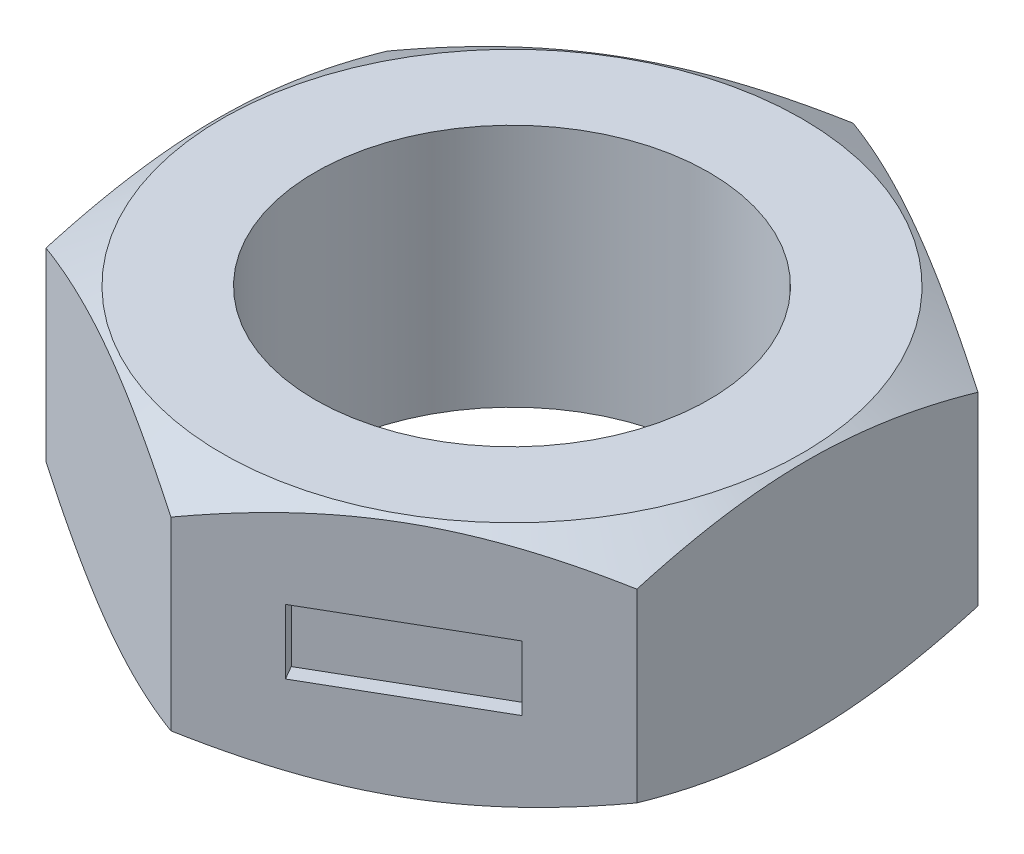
ISO-10303-21;
HEADER;
FILE_DESCRIPTION(('STEP AP214'),'2;1');
FILE_NAME('part.step','',(''),(''),'','','');
FILE_SCHEMA(('AUTOMOTIVE_DESIGN { 1 0 10303 214 1 1 1 1 }'));
ENDSEC;
DATA;
#1=APPLICATION_CONTEXT('core data for automotive mechanical design processes');
#2=APPLICATION_PROTOCOL_DEFINITION('international standard','automotive_design',2000,#1);
#3=PRODUCT_CONTEXT('',#1,'mechanical');
#4=PRODUCT('Part','Part','',(#3));
#5=PRODUCT_RELATED_PRODUCT_CATEGORY('part','',(#4));
#6=PRODUCT_DEFINITION_FORMATION('','',#4);
#7=PRODUCT_DEFINITION_CONTEXT('part definition',#1,'design');
#8=PRODUCT_DEFINITION('design','',#6,#7);
#9=PRODUCT_DEFINITION_SHAPE('','',#8);
#10=(LENGTH_UNIT() NAMED_UNIT(*) SI_UNIT(.MILLI.,.METRE.));
#11=(NAMED_UNIT(*) PLANE_ANGLE_UNIT() SI_UNIT($,.RADIAN.));
#12=(NAMED_UNIT(*) SI_UNIT($,.STERADIAN.) SOLID_ANGLE_UNIT());
#13=UNCERTAINTY_MEASURE_WITH_UNIT(LENGTH_MEASURE(1.E-05),#10,'distance_accuracy_value','');
#14=(GEOMETRIC_REPRESENTATION_CONTEXT(3) GLOBAL_UNCERTAINTY_ASSIGNED_CONTEXT((#13)) GLOBAL_UNIT_ASSIGNED_CONTEXT((#10,
#11,#12)) REPRESENTATION_CONTEXT('',''));
#15=CARTESIAN_POINT('',(0.,0.,0.));
#16=DIRECTION('',(0.,0.,1.));
#17=DIRECTION('',(1.,0.,0.));
#18=AXIS2_PLACEMENT_3D('',#15,#16,#17);
#19=CARTESIAN_POINT('',(-9.01699999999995,2.8956,2.79399999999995));
#20=DIRECTION('',(-1.,0.,0.));
#21=DIRECTION('',(0.,0.,1.));
#22=AXIS2_PLACEMENT_3D('',#19,#20,#21);
#23=PLANE('',#22);
#24=DIRECTION('',(0.,1.,0.));
#25=VECTOR('',#24,1.);
#26=CARTESIAN_POINT('',(-9.01699999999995,4.9784,-2.79400000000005));
#27=LINE('',#26,#25);
#28=CARTESIAN_POINT('',(-9.01699999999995,4.9784,-2.79400000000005));
#29=VERTEX_POINT('',#28);
#30=CARTESIAN_POINT('',(-9.01699999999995,2.8956,-2.79400000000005));
#31=VERTEX_POINT('',#30);
#32=EDGE_CURVE('E175',#29,#31,#27,.F.);
#33=ORIENTED_EDGE('',*,*,#32,.T.);
#34=DIRECTION('',(0.,0.,1.));
#35=VECTOR('',#34,1.);
#36=CARTESIAN_POINT('',(-9.01699999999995,2.8956,2.79399999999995));
#37=LINE('',#36,#35);
#38=CARTESIAN_POINT('',(-9.01699999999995,2.8956,2.79399999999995));
#39=VERTEX_POINT('',#38);
#40=EDGE_CURVE('E155',#39,#31,#37,.F.);
#41=ORIENTED_EDGE('',*,*,#40,.F.);
#42=DIRECTION('',(0.,1.,0.));
#43=VECTOR('',#42,1.);
#44=CARTESIAN_POINT('',(-9.01699999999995,2.8956,2.79399999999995));
#45=LINE('',#44,#43);
#46=CARTESIAN_POINT('',(-9.01699999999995,4.9784,2.79399999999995));
#47=VERTEX_POINT('',#46);
#48=EDGE_CURVE('E162',#39,#47,#45,.T.);
#49=ORIENTED_EDGE('',*,*,#48,.T.);
#50=DIRECTION('',(0.,0.,-1.));
#51=VECTOR('',#50,1.);
#52=CARTESIAN_POINT('',(-9.01699999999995,4.9784,-2.79400000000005));
#53=LINE('',#52,#51);
#54=EDGE_CURVE('E386',#29,#47,#53,.F.);
#55=ORIENTED_EDGE('',*,*,#54,.F.);
#56=EDGE_LOOP('',(#33,#41,#49,#55));
#57=FACE_BOUND('',#56,.T.);
#58=ADVANCED_FACE('F16',(#57),#23,.T.);
#59=CARTESIAN_POINT('',(2.08882502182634,2.8956,-9.20595106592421));
#60=DIRECTION('',(0.500000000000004,0.,-0.866025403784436));
#61=DIRECTION('',(-0.866025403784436,0.,-0.500000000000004));
#62=AXIS2_PLACEMENT_3D('',#59,#60,#61);
#63=PLANE('',#62);
#64=DIRECTION('',(0.,1.,0.));
#65=VECTOR('',#64,1.);
#66=CARTESIAN_POINT('',(6.92817497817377,4.9784,-6.41195106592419));
#67=LINE('',#66,#65);
#68=CARTESIAN_POINT('',(6.92817497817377,4.9784,-6.41195106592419));
#69=VERTEX_POINT('',#68);
#70=CARTESIAN_POINT('',(6.92817497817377,2.8956,-6.41195106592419));
#71=VERTEX_POINT('',#70);
#72=EDGE_CURVE('E374',#69,#71,#67,.F.);
#73=ORIENTED_EDGE('',*,*,#72,.T.);
#74=DIRECTION('',(0.866025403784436,0.,0.500000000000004));
#75=VECTOR('',#74,1.);
#76=CARTESIAN_POINT('',(2.08882502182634,2.8956,-9.20595106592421));
#77=LINE('',#76,#75);
#78=CARTESIAN_POINT('',(2.08882502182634,2.8956,-9.20595106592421));
#79=VERTEX_POINT('',#78);
#80=EDGE_CURVE('E377',#79,#71,#77,.T.);
#81=ORIENTED_EDGE('',*,*,#80,.F.);
#82=DIRECTION('',(0.,1.,0.));
#83=VECTOR('',#82,1.);
#84=CARTESIAN_POINT('',(2.08882502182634,2.8956,-9.20595106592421));
#85=LINE('',#84,#83);
#86=CARTESIAN_POINT('',(2.08882502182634,4.9784,-9.20595106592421));
#87=VERTEX_POINT('',#86);
#88=EDGE_CURVE('E382',#79,#87,#85,.T.);
#89=ORIENTED_EDGE('',*,*,#88,.T.);
#90=DIRECTION('',(-0.866025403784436,0.,-0.500000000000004));
#91=VECTOR('',#90,1.);
#92=CARTESIAN_POINT('',(6.92817497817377,4.9784,-6.41195106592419));
#93=LINE('',#92,#91);
#94=EDGE_CURVE('E366',#69,#87,#93,.T.);
#95=ORIENTED_EDGE('',*,*,#94,.F.);
#96=EDGE_LOOP('',(#73,#81,#89,#95));
#97=FACE_BOUND('',#96,.T.);
#98=ADVANCED_FACE('F416',(#97),#63,.T.);
#99=CARTESIAN_POINT('',(6.92817497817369,2.8956,6.41195106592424));
#100=DIRECTION('',(0.500000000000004,0.,0.866025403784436));
#101=DIRECTION('',(0.866025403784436,0.,-0.500000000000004));
#102=AXIS2_PLACEMENT_3D('',#99,#100,#101);
#103=PLANE('',#102);
#104=DIRECTION('',(0.,1.,0.));
#105=VECTOR('',#104,1.);
#106=CARTESIAN_POINT('',(2.08882502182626,4.9784,9.20595106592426));
#107=LINE('',#106,#105);
#108=CARTESIAN_POINT('',(2.08882502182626,4.9784,9.20595106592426));
#109=VERTEX_POINT('',#108);
#110=CARTESIAN_POINT('',(2.08882502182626,2.8956,9.20595106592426));
#111=VERTEX_POINT('',#110);
#112=EDGE_CURVE('E361',#109,#111,#107,.F.);
#113=ORIENTED_EDGE('',*,*,#112,.T.);
#114=DIRECTION('',(-0.866025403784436,0.,0.500000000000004));
#115=VECTOR('',#114,1.);
#116=CARTESIAN_POINT('',(6.92817497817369,2.8956,6.41195106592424));
#117=LINE('',#116,#115);
#118=CARTESIAN_POINT('',(6.92817497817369,2.8956,6.41195106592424));
#119=VERTEX_POINT('',#118);
#120=EDGE_CURVE('E359',#119,#111,#117,.T.);
#121=ORIENTED_EDGE('',*,*,#120,.F.);
#122=DIRECTION('',(0.,1.,0.));
#123=VECTOR('',#122,1.);
#124=CARTESIAN_POINT('',(6.92817497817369,2.8956,6.41195106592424));
#125=LINE('',#124,#123);
#126=CARTESIAN_POINT('',(6.92817497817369,4.9784,6.41195106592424));
#127=VERTEX_POINT('',#126);
#128=EDGE_CURVE('E351',#119,#127,#125,.T.);
#129=ORIENTED_EDGE('',*,*,#128,.T.);
#130=DIRECTION('',(0.866025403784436,0.,-0.500000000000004));
#131=VECTOR('',#130,1.);
#132=CARTESIAN_POINT('',(2.08882502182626,4.9784,9.20595106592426));
#133=LINE('',#132,#131);
#134=EDGE_CURVE('E346',#109,#127,#133,.T.);
#135=ORIENTED_EDGE('',*,*,#134,.F.);
#136=EDGE_LOOP('',(#113,#121,#129,#135));
#137=FACE_BOUND('',#136,.T.);
#138=ADVANCED_FACE('F414',(#137),#103,.T.);
#139=CARTESIAN_POINT('',(-9.01699999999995,2.8956,2.79399999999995));
#140=DIRECTION('',(0.,0.,1.));
#141=DIRECTION('',(1.,0.,0.));
#142=AXIS2_PLACEMENT_3D('',#139,#140,#141);
#143=PLANE('',#142);
#144=DIRECTION('',(1.,0.,0.));
#145=VECTOR('',#144,1.);
#146=CARTESIAN_POINT('',(-9.01699999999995,4.9784,2.79399999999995));
#147=LINE('',#146,#145);
#148=CARTESIAN_POINT('',(-9.525,4.9784,2.79399999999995));
#149=VERTEX_POINT('',#148);
#150=EDGE_CURVE('E167',#47,#149,#147,.F.);
#151=ORIENTED_EDGE('',*,*,#150,.F.);
#152=ORIENTED_EDGE('',*,*,#48,.F.);
#153=DIRECTION('',(1.,0.,0.));
#154=VECTOR('',#153,1.);
#155=CARTESIAN_POINT('',(-9.01699999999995,2.8956,2.79399999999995));
#156=LINE('',#155,#154);
#157=CARTESIAN_POINT('',(-9.52499999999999,2.8956,2.79399999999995));
#158=VERTEX_POINT('',#157);
#159=EDGE_CURVE('E165',#158,#39,#156,.T.);
#160=ORIENTED_EDGE('',*,*,#159,.F.);
#161=DIRECTION('',(0.,1.,0.));
#162=VECTOR('',#161,1.);
#163=CARTESIAN_POINT('',(-9.525,7.874,2.79399999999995));
#164=LINE('',#163,#162);
#165=EDGE_CURVE('E341',#149,#158,#164,.F.);
#166=ORIENTED_EDGE('',*,*,#165,.F.);
#167=EDGE_LOOP('',(#151,#152,#160,#166));
#168=FACE_BOUND('',#167,.T.);
#169=ADVANCED_FACE('F163',(#168),#143,.F.);
#170=CARTESIAN_POINT('',(-9.01699999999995,2.8956,2.79399999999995));
#171=DIRECTION('',(0.,1.,0.));
#172=DIRECTION('',(0.,0.,1.));
#173=AXIS2_PLACEMENT_3D('',#170,#171,#172);
#174=PLANE('',#173);
#175=ORIENTED_EDGE('',*,*,#40,.T.);
#176=DIRECTION('',(-1.,0.,0.));
#177=VECTOR('',#176,1.);
#178=CARTESIAN_POINT('',(-9.01699999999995,2.8956,-2.79400000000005));
#179=LINE('',#178,#177);
#180=CARTESIAN_POINT('',(-9.52499999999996,2.8956,-2.79400000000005));
#181=VERTEX_POINT('',#180);
#182=EDGE_CURVE('E177',#31,#181,#179,.T.);
#183=ORIENTED_EDGE('',*,*,#182,.T.);
#184=DIRECTION('',(0.,0.,1.));
#185=VECTOR('',#184,1.);
#186=CARTESIAN_POINT('',(-9.525,2.8956,5.49926131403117));
#187=LINE('',#186,#185);
#188=EDGE_CURVE('E172',#158,#181,#187,.F.);
#189=ORIENTED_EDGE('',*,*,#188,.F.);
#190=ORIENTED_EDGE('',*,*,#159,.T.);
#191=EDGE_LOOP('',(#175,#183,#189,#190));
#192=FACE_BOUND('',#191,.T.);
#193=ADVANCED_FACE('F171',(#192),#174,.T.);
#194=CARTESIAN_POINT('',(-9.01699999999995,4.9784,-2.79400000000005));
#195=DIRECTION('',(0.,0.,-1.));
#196=DIRECTION('',(-1.,0.,0.));
#197=AXIS2_PLACEMENT_3D('',#194,#195,#196);
#198=PLANE('',#197);
#199=ORIENTED_EDGE('',*,*,#182,.F.);
#200=ORIENTED_EDGE('',*,*,#32,.F.);
#201=DIRECTION('',(1.,0.,0.));
#202=VECTOR('',#201,1.);
#203=CARTESIAN_POINT('',(-9.01699999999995,4.9784,-2.79400000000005));
#204=LINE('',#203,#202);
#205=CARTESIAN_POINT('',(-9.52499999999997,4.9784,-2.79400000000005));
#206=VERTEX_POINT('',#205);
#207=EDGE_CURVE('E388',#206,#29,#204,.T.);
#208=ORIENTED_EDGE('',*,*,#207,.F.);
#209=DIRECTION('',(0.,1.,0.));
#210=VECTOR('',#209,1.);
#211=CARTESIAN_POINT('',(-9.525,7.874,-2.79400000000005));
#212=LINE('',#211,#210);
#213=EDGE_CURVE('E338',#181,#206,#212,.T.);
#214=ORIENTED_EDGE('',*,*,#213,.F.);
#215=EDGE_LOOP('',(#199,#200,#208,#214));
#216=FACE_BOUND('',#215,.T.);
#217=ADVANCED_FACE('F393',(#216),#198,.F.);
#218=CARTESIAN_POINT('',(-9.01699999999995,4.9784,-2.79400000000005));
#219=DIRECTION('',(0.,-1.,0.));
#220=DIRECTION('',(0.,0.,-1.));
#221=AXIS2_PLACEMENT_3D('',#218,#219,#220);
#222=PLANE('',#221);
#223=ORIENTED_EDGE('',*,*,#54,.T.);
#224=ORIENTED_EDGE('',*,*,#150,.T.);
#225=DIRECTION('',(0.,0.,1.));
#226=VECTOR('',#225,1.);
#227=CARTESIAN_POINT('',(-9.525,4.9784,5.49926131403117));
#228=LINE('',#227,#226);
#229=EDGE_CURVE('E328',#206,#149,#228,.T.);
#230=ORIENTED_EDGE('',*,*,#229,.F.);
#231=ORIENTED_EDGE('',*,*,#207,.T.);
#232=EDGE_LOOP('',(#223,#224,#230,#231));
#233=FACE_BOUND('',#232,.T.);
#234=ADVANCED_FACE('F396',(#233),#222,.T.);
#235=CARTESIAN_POINT('',(2.08882502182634,2.8956,-9.20595106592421));
#236=DIRECTION('',(-0.866025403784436,0.,-0.500000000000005));
#237=DIRECTION('',(-0.500000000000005,0.,0.866025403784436));
#238=AXIS2_PLACEMENT_3D('',#235,#236,#237);
#239=PLANE('',#238);
#240=DIRECTION('',(0.500000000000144,0.,-0.866025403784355));
#241=VECTOR('',#240,1.);
#242=CARTESIAN_POINT('',(2.08882502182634,4.9784,-9.20595106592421));
#243=LINE('',#242,#241);
#244=CARTESIAN_POINT('',(2.3428250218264,4.9784,-9.64589197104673));
#245=VERTEX_POINT('',#244);
#246=EDGE_CURVE('E364',#87,#245,#243,.T.);
#247=ORIENTED_EDGE('',*,*,#246,.F.);
#248=ORIENTED_EDGE('',*,*,#88,.F.);
#249=DIRECTION('',(-0.499999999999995,0.,0.866025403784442));
#250=VECTOR('',#249,1.);
#251=CARTESIAN_POINT('',(2.34282502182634,2.8956,-9.64589197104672));
#252=LINE('',#251,#250);
#253=CARTESIAN_POINT('',(2.34282502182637,2.8956,-9.64589197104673));
#254=VERTEX_POINT('',#253);
#255=EDGE_CURVE('E379',#254,#79,#252,.T.);
#256=ORIENTED_EDGE('',*,*,#255,.F.);
#257=DIRECTION('',(0.,1.,0.));
#258=VECTOR('',#257,1.);
#259=CARTESIAN_POINT('',(2.34282502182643,7.874,-9.6458919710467));
#260=LINE('',#259,#258);
#261=EDGE_CURVE('E330',#245,#254,#260,.F.);
#262=ORIENTED_EDGE('',*,*,#261,.F.);
#263=EDGE_LOOP('',(#247,#248,#256,#262));
#264=FACE_BOUND('',#263,.T.);
#265=ADVANCED_FACE('F398',(#264),#239,.F.);
#266=CARTESIAN_POINT('',(2.08882502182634,2.8956,-9.20595106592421));
#267=DIRECTION('',(0.,1.,0.));
#268=DIRECTION('',(0.,0.,1.));
#269=AXIS2_PLACEMENT_3D('',#266,#267,#268);
#270=PLANE('',#269);
#271=ORIENTED_EDGE('',*,*,#80,.T.);
#272=DIRECTION('',(0.500000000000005,0.,-0.866025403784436));
#273=VECTOR('',#272,1.);
#274=CARTESIAN_POINT('',(6.92817497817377,2.8956,-6.41195106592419));
#275=LINE('',#274,#273);
#276=CARTESIAN_POINT('',(7.18217497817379,2.8956,-6.85189197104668));
#277=VERTEX_POINT('',#276);
#278=EDGE_CURVE('E371',#71,#277,#275,.T.);
#279=ORIENTED_EDGE('',*,*,#278,.T.);
#280=DIRECTION('',(-0.866025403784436,0.,-0.500000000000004));
#281=VECTOR('',#280,1.);
#282=CARTESIAN_POINT('',(0.,2.8956,-10.9985226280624));
#283=LINE('',#282,#281);
#284=EDGE_CURVE('E332',#254,#277,#283,.F.);
#285=ORIENTED_EDGE('',*,*,#284,.F.);
#286=ORIENTED_EDGE('',*,*,#255,.T.);
#287=EDGE_LOOP('',(#271,#279,#285,#286));
#288=FACE_BOUND('',#287,.T.);
#289=ADVANCED_FACE('F404',(#288),#270,.T.);
#290=CARTESIAN_POINT('',(6.92817497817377,4.9784,-6.41195106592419));
#291=DIRECTION('',(0.866025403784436,0.,0.500000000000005));
#292=DIRECTION('',(0.500000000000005,0.,-0.866025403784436));
#293=AXIS2_PLACEMENT_3D('',#290,#291,#292);
#294=PLANE('',#293);
#295=ORIENTED_EDGE('',*,*,#278,.F.);
#296=ORIENTED_EDGE('',*,*,#72,.F.);
#297=DIRECTION('',(-0.500000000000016,0.,0.866025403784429));
#298=VECTOR('',#297,1.);
#299=CARTESIAN_POINT('',(7.18217497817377,4.9784,-6.85189197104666));
#300=LINE('',#299,#298);
#301=CARTESIAN_POINT('',(7.18217497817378,4.9784,-6.85189197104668));
#302=VERTEX_POINT('',#301);
#303=EDGE_CURVE('E368',#302,#69,#300,.T.);
#304=ORIENTED_EDGE('',*,*,#303,.F.);
#305=DIRECTION('',(0.,1.,0.));
#306=VECTOR('',#305,1.);
#307=CARTESIAN_POINT('',(7.18217497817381,7.874,-6.8518919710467));
#308=LINE('',#307,#306);
#309=EDGE_CURVE('E437',#277,#302,#308,.T.);
#310=ORIENTED_EDGE('',*,*,#309,.F.);
#311=EDGE_LOOP('',(#295,#296,#304,#310));
#312=FACE_BOUND('',#311,.T.);
#313=ADVANCED_FACE('F428',(#312),#294,.F.);
#314=CARTESIAN_POINT('',(6.92817497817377,4.9784,-6.41195106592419));
#315=DIRECTION('',(0.,-1.,0.));
#316=DIRECTION('',(0.,0.,-1.));
#317=AXIS2_PLACEMENT_3D('',#314,#315,#316);
#318=PLANE('',#317);
#319=ORIENTED_EDGE('',*,*,#94,.T.);
#320=ORIENTED_EDGE('',*,*,#246,.T.);
#321=DIRECTION('',(-0.866025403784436,0.,-0.500000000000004));
#322=VECTOR('',#321,1.);
#323=CARTESIAN_POINT('',(0.,4.9784,-10.9985226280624));
#324=LINE('',#323,#322);
#325=EDGE_CURVE('E434',#302,#245,#324,.T.);
#326=ORIENTED_EDGE('',*,*,#325,.F.);
#327=ORIENTED_EDGE('',*,*,#303,.T.);
#328=EDGE_LOOP('',(#319,#320,#326,#327));
#329=FACE_BOUND('',#328,.T.);
#330=ADVANCED_FACE('F432',(#329),#318,.T.);
#331=CARTESIAN_POINT('',(2.08882502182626,4.9784,9.20595106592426));
#332=DIRECTION('',(-0.866025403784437,0.,0.500000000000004));
#333=DIRECTION('',(0.500000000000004,0.,0.866025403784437));
#334=AXIS2_PLACEMENT_3D('',#331,#332,#333);
#335=PLANE('',#334);
#336=DIRECTION('',(0.499999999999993,0.,0.866025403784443));
#337=VECTOR('',#336,1.);
#338=CARTESIAN_POINT('',(2.08882502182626,2.8956,9.20595106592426));
#339=LINE('',#338,#337);
#340=CARTESIAN_POINT('',(2.34282502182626,2.8956,9.64589197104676));
#341=VERTEX_POINT('',#340);
#342=EDGE_CURVE('E357',#111,#341,#339,.T.);
#343=ORIENTED_EDGE('',*,*,#342,.F.);
#344=ORIENTED_EDGE('',*,*,#112,.F.);
#345=DIRECTION('',(-0.499999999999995,0.,-0.866025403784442));
#346=VECTOR('',#345,1.);
#347=CARTESIAN_POINT('',(2.34282502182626,4.9784,9.64589197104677));
#348=LINE('',#347,#346);
#349=CARTESIAN_POINT('',(2.34282502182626,4.9784,9.64589197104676));
#350=VERTEX_POINT('',#349);
#351=EDGE_CURVE('E348',#350,#109,#348,.T.);
#352=ORIENTED_EDGE('',*,*,#351,.F.);
#353=DIRECTION('',(0.,1.,0.));
#354=VECTOR('',#353,1.);
#355=CARTESIAN_POINT('',(2.34282502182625,7.874,9.64589197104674));
#356=LINE('',#355,#354);
#357=EDGE_CURVE('E483',#350,#341,#356,.F.);
#358=ORIENTED_EDGE('',*,*,#357,.T.);
#359=EDGE_LOOP('',(#343,#344,#352,#358));
#360=FACE_BOUND('',#359,.T.);
#361=ADVANCED_FACE('F454',(#360),#335,.F.);
#362=CARTESIAN_POINT('',(6.92817497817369,2.8956,6.41195106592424));
#363=DIRECTION('',(0.,1.,0.));
#364=DIRECTION('',(0.,0.,1.));
#365=AXIS2_PLACEMENT_3D('',#362,#363,#364);
#366=PLANE('',#365);
#367=ORIENTED_EDGE('',*,*,#120,.T.);
#368=ORIENTED_EDGE('',*,*,#342,.T.);
#369=DIRECTION('',(-0.866025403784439,0.,0.499999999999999));
#370=VECTOR('',#369,1.);
#371=CARTESIAN_POINT('',(0.,2.8956,10.9985226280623));
#372=LINE('',#371,#370);
#373=CARTESIAN_POINT('',(7.18217497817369,2.8956,6.85189197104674));
#374=VERTEX_POINT('',#373);
#375=EDGE_CURVE('E480',#341,#374,#372,.F.);
#376=ORIENTED_EDGE('',*,*,#375,.T.);
#377=DIRECTION('',(-0.500000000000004,0.,-0.866025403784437));
#378=VECTOR('',#377,1.);
#379=CARTESIAN_POINT('',(6.92817497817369,2.8956,6.41195106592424));
#380=LINE('',#379,#378);
#381=EDGE_CURVE('E354',#374,#119,#380,.T.);
#382=ORIENTED_EDGE('',*,*,#381,.T.);
#383=EDGE_LOOP('',(#367,#368,#376,#382));
#384=FACE_BOUND('',#383,.T.);
#385=ADVANCED_FACE('F457',(#384),#366,.T.);
#386=CARTESIAN_POINT('',(6.92817497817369,2.8956,6.41195106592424));
#387=DIRECTION('',(0.866025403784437,0.,-0.500000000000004));
#388=DIRECTION('',(-0.500000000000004,0.,-0.866025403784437));
#389=AXIS2_PLACEMENT_3D('',#386,#387,#388);
#390=PLANE('',#389);
#391=DIRECTION('',(0.499999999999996,0.,0.866025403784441));
#392=VECTOR('',#391,1.);
#393=CARTESIAN_POINT('',(6.92817497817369,4.9784,6.41195106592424));
#394=LINE('',#393,#392);
#395=CARTESIAN_POINT('',(7.18217497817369,4.9784,6.85189197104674));
#396=VERTEX_POINT('',#395);
#397=EDGE_CURVE('E86',#127,#396,#394,.T.);
#398=ORIENTED_EDGE('',*,*,#397,.F.);
#399=ORIENTED_EDGE('',*,*,#128,.F.);
#400=ORIENTED_EDGE('',*,*,#381,.F.);
#401=DIRECTION('',(0.,1.,0.));
#402=VECTOR('',#401,1.);
#403=CARTESIAN_POINT('',(7.18217497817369,7.874,6.85189197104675));
#404=LINE('',#403,#402);
#405=EDGE_CURVE('E476',#374,#396,#404,.T.);
#406=ORIENTED_EDGE('',*,*,#405,.T.);
#407=EDGE_LOOP('',(#398,#399,#400,#406));
#408=FACE_BOUND('',#407,.T.);
#409=ADVANCED_FACE('F461',(#408),#390,.F.);
#410=CARTESIAN_POINT('',(2.08882502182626,4.9784,9.20595106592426));
#411=DIRECTION('',(0.,-1.,0.));
#412=DIRECTION('',(0.,0.,-1.));
#413=AXIS2_PLACEMENT_3D('',#410,#411,#412);
#414=PLANE('',#413);
#415=ORIENTED_EDGE('',*,*,#134,.T.);
#416=ORIENTED_EDGE('',*,*,#397,.T.);
#417=DIRECTION('',(-0.866025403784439,0.,0.499999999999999));
#418=VECTOR('',#417,1.);
#419=CARTESIAN_POINT('',(0.,4.9784,10.9985226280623));
#420=LINE('',#419,#418);
#421=EDGE_CURVE('E479',#396,#350,#420,.T.);
#422=ORIENTED_EDGE('',*,*,#421,.T.);
#423=ORIENTED_EDGE('',*,*,#351,.T.);
#424=EDGE_LOOP('',(#415,#416,#422,#423));
#425=FACE_BOUND('',#424,.T.);
#426=ADVANCED_FACE('F464',(#425),#414,.T.);
#427=CARTESIAN_POINT('',(-9.525,7.874,5.49926131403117));
#428=DIRECTION('',(0.499999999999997,0.,-0.866025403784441));
#429=DIRECTION('',(-0.866025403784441,0.,-0.499999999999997));
#430=AXIS2_PLACEMENT_3D('',#427,#428,#429);
#431=PLANE('',#430);
#432=DIRECTION('',(0.,1.,0.));
#433=VECTOR('',#432,1.);
#434=CARTESIAN_POINT('',(0.,7.874,10.9985226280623));
#435=LINE('',#434,#433);
#436=CARTESIAN_POINT('',(-1.70747101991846E-08,0.952499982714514,10.9985226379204));
#437=VERTEX_POINT('',#436);
#438=CARTESIAN_POINT('',(-3.48504221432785E-08,6.92150003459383,10.9985226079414));
#439=VERTEX_POINT('',#438);
#440=EDGE_CURVE('E439',#437,#439,#435,.T.);
#441=ORIENTED_EDGE('',*,*,#440,.T.);
#442=CARTESIAN_POINT('',(-9.52500003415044,6.92150001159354,5.49926129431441));
#443=CARTESIAN_POINT('',(-9.31562139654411,6.99127940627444,5.62014610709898));
#444=CARTESIAN_POINT('',(-9.10546208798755,7.05789154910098,5.74148164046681));
#445=CARTESIAN_POINT('',(-8.68345816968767,7.18390254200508,5.98512571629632));
#446=CARTESIAN_POINT('',(-8.47161302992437,7.24329901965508,6.10743456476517));
#447=CARTESIAN_POINT('',(-7.83266430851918,7.40951541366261,6.47633178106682));
#448=CARTESIAN_POINT('',(-7.40303844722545,7.50405743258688,6.72437638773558));
#449=CARTESIAN_POINT('',(-6.76012305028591,7.61491481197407,7.09556376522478));
#450=CARTESIAN_POINT('',(-6.54875413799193,7.64649352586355,7.21759766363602));
#451=CARTESIAN_POINT('',(-6.12503778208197,7.69944807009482,7.46223041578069));
#452=CARTESIAN_POINT('',(-5.91269031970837,7.72082370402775,7.58482928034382));
#453=CARTESIAN_POINT('',(-5.48764127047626,7.75282439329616,7.83023146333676));
#454=CARTESIAN_POINT('',(-5.27494040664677,7.76346222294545,7.95303436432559));
#455=CARTESIAN_POINT('',(-4.84934231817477,7.77376126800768,8.19875353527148));
#456=CARTESIAN_POINT('',(-4.63644509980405,7.77342282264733,8.32166980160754));
#457=CARTESIAN_POINT('',(-4.23844161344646,7.76253369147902,8.5514572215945));
#458=CARTESIAN_POINT('',(-4.05330722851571,7.75331134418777,8.65834460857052));
#459=CARTESIAN_POINT('',(-3.68347146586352,7.72674534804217,8.87186938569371));
#460=CARTESIAN_POINT('',(-3.49877011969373,7.70940112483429,8.97850675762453));
#461=CARTESIAN_POINT('',(-2.94538178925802,7.64559564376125,9.29800565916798));
#462=CARTESIAN_POINT('',(-2.57767430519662,7.58736952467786,9.51030167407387));
#463=CARTESIAN_POINT('',(-1.83835936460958,7.441806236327,9.93714535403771));
#464=CARTESIAN_POINT('',(-1.46684624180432,7.353852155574,10.1516385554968));
#465=CARTESIAN_POINT('',(-0.72935956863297,7.1542338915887,10.577426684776));
#466=CARTESIAN_POINT('',(-0.363376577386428,7.04261658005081,10.788727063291));
#467=CARTESIAN_POINT('',(-7.02856196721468E-08,6.92150004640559,10.9985225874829));
#468=B_SPLINE_CURVE_WITH_KNOTS('',3,(#442,#443,#444,#445,#446,#447,#448,#449,#450,#451,#452,
#453,#454,#455,#456,#457,#458,#459,#460,#461,#462,#463,#464,#465,#466,#467),.UNSPECIFIED.,.F.,
.F.,(4,2,2,2,2,2,2,2,2,2,2,2,4),(0.,0.754853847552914,1.50995521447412,3.02337201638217,
3.76150689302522,4.49965597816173,5.23692587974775,5.97417299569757,6.61593390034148,
7.25774019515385,8.54226458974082,9.85527357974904,11.1657056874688),.UNSPECIFIED.);
#469=CARTESIAN_POINT('',(-9.525,6.9215000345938,5.49926127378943));
#470=VERTEX_POINT('',#469);
#471=EDGE_CURVE('E255',#470,#439,#468,.T.);
#472=ORIENTED_EDGE('',*,*,#471,.F.);
#473=DIRECTION('',(0.,1.,0.));
#474=VECTOR('',#473,1.);
#475=CARTESIAN_POINT('',(-9.525,7.874,5.49926131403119));
#476=LINE('',#475,#474);
#477=CARTESIAN_POINT('',(-9.52499996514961,0.952499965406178,5.49926133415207));
#478=VERTEX_POINT('',#477);
#479=EDGE_CURVE('E343',#478,#470,#476,.T.);
#480=ORIENTED_EDGE('',*,*,#479,.F.);
#481=CARTESIAN_POINT('',(-6.82180437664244E-08,0.952499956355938,10.9985225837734));
#482=CARTESIAN_POINT('',(-0.209378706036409,0.882720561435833,10.8776377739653));
#483=CARTESIAN_POINT('',(-0.419538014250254,0.816108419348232,10.7563022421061));
#484=CARTESIAN_POINT('',(-0.84154193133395,0.690097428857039,10.512658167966));
#485=CARTESIAN_POINT('',(-1.05338707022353,0.630700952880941,10.3903493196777));
#486=CARTESIAN_POINT('',(-1.69233578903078,0.464484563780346,10.0214521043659));
#487=CARTESIAN_POINT('',(-2.12196164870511,0.369942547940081,9.77340749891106));
#488=CARTESIAN_POINT('',(-2.76487704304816,0.259085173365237,9.40222012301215));
#489=CARTESIAN_POINT('',(-2.97624595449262,0.227506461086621,9.28018622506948));
#490=CARTESIAN_POINT('',(-3.39996230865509,0.174551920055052,9.03555347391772));
#491=CARTESIAN_POINT('',(-3.61230977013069,0.153176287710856,8.91295460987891));
#492=CARTESIAN_POINT('',(-4.03735881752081,0.121175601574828,8.66755242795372));
#493=CARTESIAN_POINT('',(-4.25005968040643,0.11053777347,8.54474952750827));
#494=CARTESIAN_POINT('',(-4.67565776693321,0.100238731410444,8.29903035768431));
#495=CARTESIAN_POINT('',(-4.8885549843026,0.10057717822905,8.1761140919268));
#496=CARTESIAN_POINT('',(-5.28655846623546,0.111466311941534,7.94632667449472));
#497=CARTESIAN_POINT('',(-5.47169284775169,0.120688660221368,7.83943928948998));
#498=CARTESIAN_POINT('',(-5.84152860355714,0.147254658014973,7.62591451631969));
#499=CARTESIAN_POINT('',(-6.0262299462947,0.164598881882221,7.51927714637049));
#500=CARTESIAN_POINT('',(-6.57961826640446,0.228404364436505,7.19977825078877));
#501=CARTESIAN_POINT('',(-6.94732574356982,0.286630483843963,6.9874822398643));
#502=CARTESIAN_POINT('',(-7.68664067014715,0.432193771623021,6.56063856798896));
#503=CARTESIAN_POINT('',(-8.05815378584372,0.520147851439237,6.34614537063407));
#504=CARTESIAN_POINT('',(-8.7956404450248,0.71976611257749,5.92035724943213));
#505=CARTESIAN_POINT('',(-9.16162342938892,0.831383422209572,5.70905687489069));
#506=CARTESIAN_POINT('',(-9.52499992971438,0.952499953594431,5.49926135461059));
#507=B_SPLINE_CURVE_WITH_KNOTS('',3,(#481,#482,#483,#484,#485,#486,#487,#488,#489,#490,#491,
#492,#493,#494,#495,#496,#497,#498,#499,#500,#501,#502,#503,#504,#505,#506),.UNSPECIFIED.,.F.,
.F.,(4,2,2,2,2,2,2,2,2,2,2,2,4),(0.,0.754853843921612,1.50995520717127,3.02337200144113,
3.76150687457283,4.49965595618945,5.23692585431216,5.97417296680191,6.61593385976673,
7.25774014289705,8.54226451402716,9.8552734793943,11.1657055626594),.UNSPECIFIED.);
#508=EDGE_CURVE('E315',#437,#478,#507,.T.);
#509=ORIENTED_EDGE('',*,*,#508,.F.);
#510=EDGE_LOOP('',(#441,#472,#480,#509));
#511=FACE_BOUND('',#510,.T.);
#512=ADVANCED_FACE('F244',(#511),#431,.F.);
#513=CARTESIAN_POINT('',(-9.525,7.874,5.49926131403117));
#514=DIRECTION('',(-1.,0.,0.));
#515=DIRECTION('',(0.,0.,1.));
#516=AXIS2_PLACEMENT_3D('',#513,#514,#515);
#517=PLANE('',#516);
#518=ORIENTED_EDGE('',*,*,#213,.T.);
#519=ORIENTED_EDGE('',*,*,#229,.T.);
#520=ORIENTED_EDGE('',*,*,#165,.T.);
#521=ORIENTED_EDGE('',*,*,#188,.T.);
#522=EDGE_LOOP('',(#518,#519,#520,#521));
#523=FACE_BOUND('',#522,.T.);
#524=ORIENTED_EDGE('',*,*,#479,.T.);
#525=CARTESIAN_POINT('',(-9.525,6.92150001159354,-5.4992613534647));
#526=CARTESIAN_POINT('',(-9.525,6.99127940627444,-5.25749172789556));
#527=CARTESIAN_POINT('',(-9.525,7.05789154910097,-5.01482066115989));
#528=CARTESIAN_POINT('',(-9.525,7.18390254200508,-4.52753250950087));
#529=CARTESIAN_POINT('',(-9.525,7.24329901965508,-4.28291481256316));
#530=CARTESIAN_POINT('',(-9.525,7.40951541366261,-3.54512037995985));
#531=CARTESIAN_POINT('',(-9.525,7.50405743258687,-3.04903116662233));
#532=CARTESIAN_POINT('',(-9.525,7.61491481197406,-2.30665641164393));
#533=CARTESIAN_POINT('',(-9.525,7.64649352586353,-2.06258861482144));
#534=CARTESIAN_POINT('',(-9.525,7.69944807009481,-1.57332311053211));
#535=CARTESIAN_POINT('',(-9.525,7.72082370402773,-1.32812538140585));
#536=CARTESIAN_POINT('',(-9.525,7.75282439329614,-0.83732101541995));
#537=CARTESIAN_POINT('',(-9.525,7.76346222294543,-0.591715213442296));
#538=CARTESIAN_POINT('',(-9.525,7.77376126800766,-0.100276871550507));
#539=CARTESIAN_POINT('',(-9.525,7.77342282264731,0.145555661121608));
#540=CARTESIAN_POINT('',(-9.525,7.762533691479,0.60513050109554));
#541=CARTESIAN_POINT('',(-9.525,7.75331134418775,0.818905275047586));
#542=CARTESIAN_POINT('',(-9.525,7.72674534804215,1.24595482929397));
#543=CARTESIAN_POINT('',(-9.525,7.70940112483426,1.45922957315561));
#544=CARTESIAN_POINT('',(-9.525,7.64559564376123,2.09822737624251));
#545=CARTESIAN_POINT('',(-9.525,7.58736952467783,2.5228194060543));
#546=CARTESIAN_POINT('',(-9.525,7.44180623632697,3.37650676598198));
#547=CARTESIAN_POINT('',(-9.525,7.35385215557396,3.80549316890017));
#548=CARTESIAN_POINT('',(-9.525,7.15423389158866,4.65706942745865));
#549=CARTESIAN_POINT('',(-9.525,7.04261658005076,5.07967018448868));
#550=CARTESIAN_POINT('',(-9.525,6.92150004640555,5.49926123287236));
#551=B_SPLINE_CURVE_WITH_KNOTS('',3,(#525,#526,#527,#528,#529,#530,#531,#532,#533,#534,#535,
#536,#537,#538,#539,#540,#541,#542,#543,#544,#545,#546,#547,#548,#549,#550),.UNSPECIFIED.,.F.,
.F.,(4,2,2,2,2,2,2,2,2,2,2,2,4),(0.,0.754853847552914,1.50995521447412,3.02337201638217,
3.76150689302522,4.49965597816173,5.23692587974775,5.97417299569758,6.61593390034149,
7.25774019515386,8.54226458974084,9.85527357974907,11.1657056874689),.UNSPECIFIED.);
#552=CARTESIAN_POINT('',(-9.52499996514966,6.92150003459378,-5.49926133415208));
#553=VERTEX_POINT('',#552);
#554=EDGE_CURVE('E249',#553,#470,#551,.T.);
#555=ORIENTED_EDGE('',*,*,#554,.F.);
#556=DIRECTION('',(0.,1.,0.));
#557=VECTOR('',#556,1.);
#558=CARTESIAN_POINT('',(-9.52500000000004,7.874,-5.4992613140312));
#559=LINE('',#558,#557);
#560=CARTESIAN_POINT('',(-9.52500000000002,0.95249996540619,-5.49926127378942));
#561=VERTEX_POINT('',#560);
#562=EDGE_CURVE('E327',#561,#553,#559,.T.);
#563=ORIENTED_EDGE('',*,*,#562,.F.);
#564=CARTESIAN_POINT('',(-9.525,0.952499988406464,5.49926135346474));
#565=CARTESIAN_POINT('',(-9.525,0.882720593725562,5.2574917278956));
#566=CARTESIAN_POINT('',(-9.525,0.816108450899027,5.01482066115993));
#567=CARTESIAN_POINT('',(-9.525,0.690097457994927,4.52753250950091));
#568=CARTESIAN_POINT('',(-9.525,0.630700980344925,4.2829148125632));
#569=CARTESIAN_POINT('',(-9.525,0.464484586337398,3.54512037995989));
#570=CARTESIAN_POINT('',(-9.525,0.369942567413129,3.04903116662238));
#571=CARTESIAN_POINT('',(-9.525,0.259085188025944,2.30665641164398));
#572=CARTESIAN_POINT('',(-9.525,0.227506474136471,2.06258861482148));
#573=CARTESIAN_POINT('',(-9.525,0.174551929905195,1.57332311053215));
#574=CARTESIAN_POINT('',(-9.525,0.153176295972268,1.3281253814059));
#575=CARTESIAN_POINT('',(-9.525,0.12117560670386,0.837321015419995));
#576=CARTESIAN_POINT('',(-9.525,0.110537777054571,0.591715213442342));
#577=CARTESIAN_POINT('',(-9.525,0.100238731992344,0.100276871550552));
#578=CARTESIAN_POINT('',(-9.525,0.10057717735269,-0.145555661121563));
#579=CARTESIAN_POINT('',(-9.525,0.111466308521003,-0.605130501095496));
#580=CARTESIAN_POINT('',(-9.525,0.120688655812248,-0.818905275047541));
#581=CARTESIAN_POINT('',(-9.525,0.14725465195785,-1.24595482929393));
#582=CARTESIAN_POINT('',(-9.525,0.164598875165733,-1.45922957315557));
#583=CARTESIAN_POINT('',(-9.525,0.228404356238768,-2.09822737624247));
#584=CARTESIAN_POINT('',(-9.525,0.286630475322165,-2.52281940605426));
#585=CARTESIAN_POINT('',(-9.525,0.432193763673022,-3.37650676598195));
#586=CARTESIAN_POINT('',(-9.525,0.520147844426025,-3.80549316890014));
#587=CARTESIAN_POINT('',(-9.525,0.719766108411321,-4.65706942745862));
#588=CARTESIAN_POINT('',(-9.525,0.831383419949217,-5.07967018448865));
#589=CARTESIAN_POINT('',(-9.525,0.952499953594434,-5.49926123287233));
#590=B_SPLINE_CURVE_WITH_KNOTS('',3,(#564,#565,#566,#567,#568,#569,#570,#571,#572,#573,#574,
#575,#576,#577,#578,#579,#580,#581,#582,#583,#584,#585,#586,#587,#588,#589),.UNSPECIFIED.,.F.,
.F.,(4,2,2,2,2,2,2,2,2,2,2,2,4),(0.,0.754853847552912,1.50995521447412,3.02337201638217,
3.76150689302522,4.49965597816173,5.23692587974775,5.97417299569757,6.61593390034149,
7.25774019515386,8.54226458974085,9.85527357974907,11.1657056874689),.UNSPECIFIED.);
#591=EDGE_CURVE('E214',#478,#561,#590,.T.);
#592=ORIENTED_EDGE('',*,*,#591,.F.);
#593=EDGE_LOOP('',(#524,#555,#563,#592));
#594=FACE_BOUND('',#593,.T.);
#595=ADVANCED_FACE('F237',(#523,#594),#517,.T.);
#596=CARTESIAN_POINT('',(-9.525,7.874,-5.49926131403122));
#597=DIRECTION('',(-0.5,0.,-0.866025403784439));
#598=DIRECTION('',(-0.866025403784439,0.,0.5));
#599=AXIS2_PLACEMENT_3D('',#596,#597,#598);
#600=PLANE('',#599);
#601=ORIENTED_EDGE('',*,*,#562,.T.);
#602=CARTESIAN_POINT('',(-1.777515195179E-08,6.92150002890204,-10.9985226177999));
#603=CARTESIAN_POINT('',(-0.20937865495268,6.99127942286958,-10.8776378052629));
#604=CARTESIAN_POINT('',(-0.419537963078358,7.05789156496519,-10.7563022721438));
#605=CARTESIAN_POINT('',(-0.841541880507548,7.18390255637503,-10.512658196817));
#606=CARTESIAN_POINT('',(-1.05338701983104,7.24329903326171,-10.3903493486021));
#607=CARTESIAN_POINT('',(-1.69233573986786,7.40951542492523,-10.0214521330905));
#608=CARTESIAN_POINT('',(-2.12196160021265,7.50405744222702,-9.77340752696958));
#609=CARTESIAN_POINT('',(-2.76487699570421,7.61491481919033,-9.40222015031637));
#610=CARTESIAN_POINT('',(-2.97624590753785,7.64649353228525,-9.2801862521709));
#611=CARTESIAN_POINT('',(-3.39996226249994,7.69944807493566,-9.03555350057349));
#612=CARTESIAN_POINT('',(-3.612309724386,7.72082370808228,-8.91295463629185));
#613=CARTESIAN_POINT('',(-4.03735877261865,7.75282439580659,-8.66755245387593));
#614=CARTESIAN_POINT('',(-4.25005963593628,7.76346222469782,-8.54474955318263));
#615=CARTESIAN_POINT('',(-4.67565772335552,7.77376126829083,-8.29903038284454));
#616=CARTESIAN_POINT('',(-4.88855494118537,7.77342282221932,-8.17611411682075));
#617=CARTESIAN_POINT('',(-5.28655842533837,7.76253368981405,-7.94632669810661));
#618=CARTESIAN_POINT('',(-5.47169280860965,7.75331134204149,-7.83943931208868));
#619=CARTESIAN_POINT('',(-5.84152856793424,7.72674534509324,-7.62591453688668));
#620=CARTESIAN_POINT('',(-6.02622991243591,7.70940112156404,-7.51927716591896));
#621=CARTESIAN_POINT('',(-6.57961823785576,7.64559563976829,-7.19977826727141));
#622=CARTESIAN_POINT('',(-6.94732571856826,7.58736952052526,-6.98748225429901));
#623=CARTESIAN_POINT('',(-7.68664065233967,7.44180623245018,-6.56063857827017));
#624=CARTESIAN_POINT('',(-8.05815377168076,7.35385215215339,-6.34614537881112));
#625=CARTESIAN_POINT('',(-8.79564043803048,7.15423388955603,-5.92035725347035));
#626=CARTESIAN_POINT('',(-9.1616234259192,7.04261657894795,-5.70905687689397));
#627=CARTESIAN_POINT('',(-9.52499992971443,6.92150004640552,-5.49926135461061));
#628=B_SPLINE_CURVE_WITH_KNOTS('',3,(#602,#603,#604,#605,#606,#607,#608,#609,#610,#611,#612,
#613,#614,#615,#616,#617,#618,#619,#620,#621,#622,#623,#624,#625,#626,#627),.UNSPECIFIED.,.F.,
.F.,(4,2,2,2,2,2,2,2,2,2,2,2,4),(0.,0.75485384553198,1.50995521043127,3.02337200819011,
3.76150688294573,4.49965596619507,5.23692586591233,5.97417297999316,6.61593387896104,
7.25774016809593,8.54226455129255,9.855273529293,11.1657056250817),.UNSPECIFIED.);
#629=CARTESIAN_POINT('',(8.88760617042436E-09,6.92150002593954,-10.9985226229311));
#630=VERTEX_POINT('',#629);
#631=EDGE_CURVE('E19',#630,#553,#628,.T.);
#632=ORIENTED_EDGE('',*,*,#631,.F.);
#633=DIRECTION('',(0.,1.,0.));
#634=VECTOR('',#633,1.);
#635=CARTESIAN_POINT('',(0.,7.874,-10.9985226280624));
#636=LINE('',#635,#634);
#637=CARTESIAN_POINT('',(-3.48503840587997E-08,0.952499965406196,-10.9985226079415));
#638=VERTEX_POINT('',#637);
#639=EDGE_CURVE('E76',#638,#630,#636,.T.);
#640=ORIENTED_EDGE('',*,*,#639,.F.);
#641=CARTESIAN_POINT('',(-9.52500003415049,0.952499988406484,-5.49926129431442));
#642=CARTESIAN_POINT('',(-9.31562139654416,0.882720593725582,-5.620146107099));
#643=CARTESIAN_POINT('',(-9.1054620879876,0.816108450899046,-5.74148164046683));
#644=CARTESIAN_POINT('',(-8.68345816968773,0.690097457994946,-5.98512571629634));
#645=CARTESIAN_POINT('',(-8.47161302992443,0.630700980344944,-6.1074345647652));
#646=CARTESIAN_POINT('',(-7.83266430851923,0.464484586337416,-6.47633178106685));
#647=CARTESIAN_POINT('',(-7.40303844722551,0.369942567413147,-6.72437638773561));
#648=CARTESIAN_POINT('',(-6.76012305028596,0.259085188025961,-7.09556376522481));
#649=CARTESIAN_POINT('',(-6.54875413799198,0.227506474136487,-7.21759766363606));
#650=CARTESIAN_POINT('',(-6.12503778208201,0.174551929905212,-7.46223041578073));
#651=CARTESIAN_POINT('',(-5.91269031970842,0.153176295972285,-7.58482928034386));
#652=CARTESIAN_POINT('',(-5.48764127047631,0.121175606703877,-7.8302314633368));
#653=CARTESIAN_POINT('',(-5.27494040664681,0.110537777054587,-7.95303436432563));
#654=CARTESIAN_POINT('',(-4.84934231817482,0.100238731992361,-8.19875353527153));
#655=CARTESIAN_POINT('',(-4.6364450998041,0.100577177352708,-8.32166980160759));
#656=CARTESIAN_POINT('',(-4.2384416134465,0.111466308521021,-8.55145722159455));
#657=CARTESIAN_POINT('',(-4.05330722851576,0.120688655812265,-8.65834460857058));
#658=CARTESIAN_POINT('',(-3.68347146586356,0.147254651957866,-8.87186938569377));
#659=CARTESIAN_POINT('',(-3.49877011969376,0.16459887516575,-8.97850675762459));
#660=CARTESIAN_POINT('',(-2.94538178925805,0.228404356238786,-9.29800565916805));
#661=CARTESIAN_POINT('',(-2.57767430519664,0.286630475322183,-9.51030167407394));
#662=CARTESIAN_POINT('',(-1.83835936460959,0.432193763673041,-9.93714535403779));
#663=CARTESIAN_POINT('',(-1.46684624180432,0.520147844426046,-10.1516385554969));
#664=CARTESIAN_POINT('',(-0.729359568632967,0.719766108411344,-10.5774266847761));
#665=CARTESIAN_POINT('',(-0.363376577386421,0.831383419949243,-10.7887270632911));
#666=CARTESIAN_POINT('',(-7.02856062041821E-08,0.95249995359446,-10.998522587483));
#667=B_SPLINE_CURVE_WITH_KNOTS('',3,(#641,#642,#643,#644,#645,#646,#647,#648,#649,#650,#651,
#652,#653,#654,#655,#656,#657,#658,#659,#660,#661,#662,#663,#664,#665,#666),.UNSPECIFIED.,.F.,
.F.,(4,2,2,2,2,2,2,2,2,2,2,2,4),(0.,0.754853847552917,1.50995521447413,3.02337201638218,
3.76150689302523,4.49965597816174,5.23692587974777,5.97417299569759,6.61593390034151,
7.25774019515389,8.54226458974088,9.85527357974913,11.1657056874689),.UNSPECIFIED.);
#668=EDGE_CURVE('E229',#561,#638,#667,.T.);
#669=ORIENTED_EDGE('',*,*,#668,.F.);
#670=EDGE_LOOP('',(#601,#632,#640,#669));
#671=FACE_BOUND('',#670,.T.);
#672=ADVANCED_FACE('F233',(#671),#600,.T.);
#673=CARTESIAN_POINT('',(0.,7.874,-10.9985226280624));
#674=DIRECTION('',(0.500000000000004,0.,-0.866025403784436));
#675=DIRECTION('',(-0.866025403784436,0.,-0.500000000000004));
#676=AXIS2_PLACEMENT_3D('',#673,#674,#675);
#677=PLANE('',#676);
#678=ORIENTED_EDGE('',*,*,#309,.T.);
#679=ORIENTED_EDGE('',*,*,#325,.T.);
#680=ORIENTED_EDGE('',*,*,#261,.T.);
#681=ORIENTED_EDGE('',*,*,#284,.T.);
#682=EDGE_LOOP('',(#678,#679,#680,#681));
#683=FACE_BOUND('',#682,.T.);
#684=ORIENTED_EDGE('',*,*,#639,.T.);
#685=CARTESIAN_POINT('',(9.52500003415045,6.92150001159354,-5.49926129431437));
#686=CARTESIAN_POINT('',(9.3156213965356,6.99127940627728,-5.62014610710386));
#687=CARTESIAN_POINT('',(9.10546208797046,7.0578915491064,-5.74148164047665));
#688=CARTESIAN_POINT('',(8.68345816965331,7.18390254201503,-5.98512571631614));
#689=CARTESIAN_POINT('',(8.47161302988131,7.24329901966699,-6.10743456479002));
#690=CARTESIAN_POINT('',(7.83266430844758,7.40951541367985,-6.47633178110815));
#691=CARTESIAN_POINT('',(7.40303844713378,7.50405743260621,-6.7243763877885));
#692=CARTESIAN_POINT('',(6.76012305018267,7.61491481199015,-7.09556376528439));
#693=CARTESIAN_POINT('',(6.54875413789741,7.64649352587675,-7.2175976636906));
#694=CARTESIAN_POINT('',(6.12503778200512,7.69944807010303,-7.46223041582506));
#695=CARTESIAN_POINT('',(5.91269031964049,7.72082370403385,-7.58482928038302));
#696=CARTESIAN_POINT('',(5.48764127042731,7.75282439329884,-7.83023146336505));
#697=CARTESIAN_POINT('',(5.27494040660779,7.76346222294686,-7.95303436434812));
#698=CARTESIAN_POINT('',(4.84934231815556,7.77376126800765,-8.1987535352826));
#699=CARTESIAN_POINT('',(4.63644509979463,7.77342282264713,-8.32166980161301));
#700=CARTESIAN_POINT('',(4.23844161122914,7.76253369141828,-8.55145722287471));
#701=CARTESIAN_POINT('',(4.0533072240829,7.75331134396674,-8.65834461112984));
#702=CARTESIAN_POINT('',(3.68347145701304,7.72674534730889,-8.87186939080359));
#703=CARTESIAN_POINT('',(3.49877010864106,7.70940112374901,-8.97850676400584));
#704=CARTESIAN_POINT('',(2.94538177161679,7.64559564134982,-9.2980056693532));
#705=CARTESIAN_POINT('',(2.57767428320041,7.58736952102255,-9.51030168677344));
#706=CARTESIAN_POINT('',(1.83835933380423,7.4418062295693,-9.93714537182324));
#707=CARTESIAN_POINT('',(1.46684620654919,7.35385214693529,-10.1516385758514));
#708=CARTESIAN_POINT('',(0.729359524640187,7.15423387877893,-10.5774267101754));
#709=CARTESIAN_POINT('',(0.363376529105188,7.04261656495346,-10.7887270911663));
#710=CARTESIAN_POINT('',(1.77752129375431E-08,6.92150002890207,-10.9985226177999));
#711=B_SPLINE_CURVE_WITH_KNOTS('',3,(#685,#686,#687,#688,#689,#690,#691,#692,#693,#694,#695,
#696,#697,#698,#699,#700,#701,#702,#703,#704,#705,#706,#707,#708,#709,#710),.UNSPECIFIED.,.F.,
.F.,(4,2,2,2,2,2,2,2,2,2,2,2,4),(0.,0.754853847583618,1.50995521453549,3.02337201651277,
3.76150689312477,4.49965597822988,5.23692587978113,5.97417299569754,6.61593390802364,
7.25774021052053,8.5422646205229,9.85527362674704,11.1657057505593),.UNSPECIFIED.);
#712=CARTESIAN_POINT('',(9.525,6.92150003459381,-5.4992612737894));
#713=VERTEX_POINT('',#712);
#714=EDGE_CURVE('E272',#713,#630,#711,.T.);
#715=ORIENTED_EDGE('',*,*,#714,.F.);
#716=DIRECTION('',(0.,1.,0.));
#717=VECTOR('',#716,1.);
#718=CARTESIAN_POINT('',(9.525,7.874,-5.49926131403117));
#719=LINE('',#718,#717);
#720=CARTESIAN_POINT('',(9.52499996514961,0.952499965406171,-5.49926133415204));
#721=VERTEX_POINT('',#720);
#722=EDGE_CURVE('E314',#713,#721,#719,.F.);
#723=ORIENTED_EDGE('',*,*,#722,.T.);
#724=CARTESIAN_POINT('',(-3.41504588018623E-08,0.952499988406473,-10.9985226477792));
#725=CARTESIAN_POINT('',(0.209378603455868,0.882720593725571,-10.8776378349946));
#726=CARTESIAN_POINT('',(0.41953791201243,0.816108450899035,-10.7563023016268));
#727=CARTESIAN_POINT('',(0.841541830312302,0.690097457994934,-10.5126582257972));
#728=CARTESIAN_POINT('',(1.0533869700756,0.630700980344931,-10.3903493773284));
#729=CARTESIAN_POINT('',(1.69233569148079,0.464484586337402,-10.0214521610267));
#730=CARTESIAN_POINT('',(2.12196155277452,0.369942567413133,-9.77340755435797));
#731=CARTESIAN_POINT('',(2.76487694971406,0.259085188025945,-9.40222017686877));
#732=CARTESIAN_POINT('',(2.97624586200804,0.22750647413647,-9.28018627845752));
#733=CARTESIAN_POINT('',(3.399962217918,0.174551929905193,-9.03555352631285));
#734=CARTESIAN_POINT('',(3.6123096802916,0.153176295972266,-8.91295466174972));
#735=CARTESIAN_POINT('',(4.0373587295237,0.121175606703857,-8.66755247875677));
#736=CARTESIAN_POINT('',(4.2500595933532,0.110537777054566,-8.54474957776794));
#737=CARTESIAN_POINT('',(4.67565768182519,0.100238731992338,-8.29903040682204));
#738=CARTESIAN_POINT('',(4.88855490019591,0.100577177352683,-8.17611414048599));
#739=CARTESIAN_POINT('',(5.2865583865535,0.111466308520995,-7.94632672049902));
#740=CARTESIAN_POINT('',(5.47169277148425,0.120688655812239,-7.83943933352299));
#741=CARTESIAN_POINT('',(5.84152853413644,0.14725465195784,-7.6259145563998));
#742=CARTESIAN_POINT('',(6.02622988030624,0.164598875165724,-7.51927718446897));
#743=CARTESIAN_POINT('',(6.57961821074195,0.228404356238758,-7.19977828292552));
#744=CARTESIAN_POINT('',(6.94732569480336,0.286630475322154,-6.98748226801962));
#745=CARTESIAN_POINT('',(7.68664063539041,0.432193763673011,-6.56063858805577));
#746=CARTESIAN_POINT('',(8.05815375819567,0.520147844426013,-6.34614538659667));
#747=CARTESIAN_POINT('',(8.79564043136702,0.71976610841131,-5.92035725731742));
#748=CARTESIAN_POINT('',(9.16162342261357,0.831383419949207,-5.7090568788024));
#749=CARTESIAN_POINT('',(9.52499992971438,0.952499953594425,-5.49926135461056));
#750=B_SPLINE_CURVE_WITH_KNOTS('',3,(#724,#725,#726,#727,#728,#729,#730,#731,#732,#733,#734,
#735,#736,#737,#738,#739,#740,#741,#742,#743,#744,#745,#746,#747,#748,#749),.UNSPECIFIED.,.F.,
.F.,(4,2,2,2,2,2,2,2,2,2,2,2,4),(0.,0.754853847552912,1.50995521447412,3.02337201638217,
3.76150689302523,4.49965597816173,5.23692587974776,5.97417299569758,6.6159339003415,
7.25774019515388,8.54226458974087,9.85527357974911,11.1657056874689),.UNSPECIFIED.);
#751=EDGE_CURVE('E224',#638,#721,#750,.T.);
#752=ORIENTED_EDGE('',*,*,#751,.F.);
#753=EDGE_LOOP('',(#684,#715,#723,#752));
#754=FACE_BOUND('',#753,.T.);
#755=ADVANCED_FACE('F236',(#683,#754),#677,.T.);
#756=CARTESIAN_POINT('',(9.525,7.874,5.49926131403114));
#757=DIRECTION('',(-1.,0.,0.));
#758=DIRECTION('',(0.,0.,1.));
#759=AXIS2_PLACEMENT_3D('',#756,#757,#758);
#760=PLANE('',#759);
#761=ORIENTED_EDGE('',*,*,#722,.F.);
#762=CARTESIAN_POINT('',(9.525,6.92150001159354,5.49926135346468));
#763=CARTESIAN_POINT('',(9.525,6.99127940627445,5.25749172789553));
#764=CARTESIAN_POINT('',(9.525,7.05789154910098,5.01482066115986));
#765=CARTESIAN_POINT('',(9.525,7.18390254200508,4.52753250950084));
#766=CARTESIAN_POINT('',(9.525,7.24329901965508,4.28291481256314));
#767=CARTESIAN_POINT('',(9.525,7.40951541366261,3.54512037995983));
#768=CARTESIAN_POINT('',(9.525,7.50405743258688,3.04903116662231));
#769=CARTESIAN_POINT('',(9.525,7.61491481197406,2.30665641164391));
#770=CARTESIAN_POINT('',(9.525,7.64649352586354,2.06258861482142));
#771=CARTESIAN_POINT('',(9.525,7.69944807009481,1.57332311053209));
#772=CARTESIAN_POINT('',(9.525,7.72082370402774,1.32812538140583));
#773=CARTESIAN_POINT('',(9.525,7.75282439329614,0.837321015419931));
#774=CARTESIAN_POINT('',(9.525,7.76346222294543,0.591715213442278));
#775=CARTESIAN_POINT('',(9.525,7.77376126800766,0.100276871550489));
#776=CARTESIAN_POINT('',(9.525,7.77342282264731,-0.145555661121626));
#777=CARTESIAN_POINT('',(9.525,7.762533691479,-0.605130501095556));
#778=CARTESIAN_POINT('',(9.525,7.75331134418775,-0.818905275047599));
#779=CARTESIAN_POINT('',(9.525,7.72674534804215,-1.24595482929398));
#780=CARTESIAN_POINT('',(9.525,7.70940112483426,-1.45922957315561));
#781=CARTESIAN_POINT('',(9.525,7.64559564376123,-2.09822737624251));
#782=CARTESIAN_POINT('',(9.525,7.58736952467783,-2.52281940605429));
#783=CARTESIAN_POINT('',(9.525,7.44180623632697,-3.37650676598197));
#784=CARTESIAN_POINT('',(9.525,7.35385215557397,-3.80549316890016));
#785=CARTESIAN_POINT('',(9.525,7.15423389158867,-4.65706942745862));
#786=CARTESIAN_POINT('',(9.525,7.04261658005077,-5.07967018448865));
#787=CARTESIAN_POINT('',(9.525,6.92150004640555,-5.49926123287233));
#788=B_SPLINE_CURVE_WITH_KNOTS('',3,(#762,#763,#764,#765,#766,#767,#768,#769,#770,#771,#772,
#773,#774,#775,#776,#777,#778,#779,#780,#781,#782,#783,#784,#785,#786,#787),.UNSPECIFIED.,.F.,
.F.,(4,2,2,2,2,2,2,2,2,2,2,2,4),(0.,0.754853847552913,1.50995521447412,3.02337201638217,
3.76150689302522,4.49965597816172,5.23692587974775,5.97417299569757,6.61593390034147,
7.25774019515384,8.54226458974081,9.85527357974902,11.1657056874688),.UNSPECIFIED.);
#789=CARTESIAN_POINT('',(9.52499996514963,6.92150003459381,5.49926133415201));
#790=VERTEX_POINT('',#789);
#791=EDGE_CURVE('E266',#790,#713,#788,.T.);
#792=ORIENTED_EDGE('',*,*,#791,.F.);
#793=DIRECTION('',(0.,1.,0.));
#794=VECTOR('',#793,1.);
#795=CARTESIAN_POINT('',(9.52500000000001,7.874,5.49926131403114));
#796=LINE('',#795,#794);
#797=CARTESIAN_POINT('',(9.52500000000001,0.952499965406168,5.49926127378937));
#798=VERTEX_POINT('',#797);
#799=EDGE_CURVE('E488',#790,#798,#796,.F.);
#800=ORIENTED_EDGE('',*,*,#799,.T.);
#801=CARTESIAN_POINT('',(9.525,0.952499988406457,-5.49926135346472));
#802=CARTESIAN_POINT('',(9.525,0.882720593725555,-5.25749172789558));
#803=CARTESIAN_POINT('',(9.525,0.816108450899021,-5.0148206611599));
#804=CARTESIAN_POINT('',(9.525,0.690097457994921,-4.52753250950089));
#805=CARTESIAN_POINT('',(9.525,0.630700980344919,-4.28291481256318));
#806=CARTESIAN_POINT('',(9.525,0.464484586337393,-3.54512037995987));
#807=CARTESIAN_POINT('',(9.525,0.369942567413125,-3.04903116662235));
#808=CARTESIAN_POINT('',(9.525,0.259085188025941,-2.30665641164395));
#809=CARTESIAN_POINT('',(9.525,0.227506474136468,-2.06258861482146));
#810=CARTESIAN_POINT('',(9.525,0.174551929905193,-1.57332311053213));
#811=CARTESIAN_POINT('',(9.525,0.153176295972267,-1.32812538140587));
#812=CARTESIAN_POINT('',(9.525,0.121175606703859,-0.837321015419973));
#813=CARTESIAN_POINT('',(9.525,0.11053777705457,-0.59171521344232));
#814=CARTESIAN_POINT('',(9.525,0.100238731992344,-0.100276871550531));
#815=CARTESIAN_POINT('',(9.525,0.100577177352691,0.145555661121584));
#816=CARTESIAN_POINT('',(9.525,0.111466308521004,0.605130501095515));
#817=CARTESIAN_POINT('',(9.525,0.120688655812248,0.818905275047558));
#818=CARTESIAN_POINT('',(9.525,0.14725465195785,1.24595482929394));
#819=CARTESIAN_POINT('',(9.525,0.164598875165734,1.45922957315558));
#820=CARTESIAN_POINT('',(9.525,0.22840435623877,2.09822737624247));
#821=CARTESIAN_POINT('',(9.525,0.286630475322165,2.52281940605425));
#822=CARTESIAN_POINT('',(9.525,0.43219376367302,3.37650676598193));
#823=CARTESIAN_POINT('',(9.525,0.520147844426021,3.80549316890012));
#824=CARTESIAN_POINT('',(9.525,0.719766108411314,4.65706942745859));
#825=CARTESIAN_POINT('',(9.525,0.831383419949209,5.07967018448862));
#826=CARTESIAN_POINT('',(9.525,0.952499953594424,5.4992612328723));
#827=B_SPLINE_CURVE_WITH_KNOTS('',3,(#801,#802,#803,#804,#805,#806,#807,#808,#809,#810,#811,
#812,#813,#814,#815,#816,#817,#818,#819,#820,#821,#822,#823,#824,#825,#826),.UNSPECIFIED.,.F.,
.F.,(4,2,2,2,2,2,2,2,2,2,2,2,4),(0.,0.754853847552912,1.50995521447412,3.02337201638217,
3.76150689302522,4.49965597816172,5.23692587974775,5.97417299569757,6.61593390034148,
7.25774019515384,8.54226458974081,9.85527357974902,11.1657056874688),.UNSPECIFIED.);
#828=EDGE_CURVE('E39',#721,#798,#827,.T.);
#829=ORIENTED_EDGE('',*,*,#828,.F.);
#830=EDGE_LOOP('',(#761,#792,#800,#829));
#831=FACE_BOUND('',#830,.T.);
#832=ADVANCED_FACE('F276',(#831),#760,.F.);
#833=CARTESIAN_POINT('',(0.,7.874,10.9985226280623));
#834=DIRECTION('',(-0.499999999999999,0.,-0.866025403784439));
#835=DIRECTION('',(-0.866025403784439,0.,0.499999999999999));
#836=AXIS2_PLACEMENT_3D('',#833,#834,#835);
#837=PLANE('',#836);
#838=ORIENTED_EDGE('',*,*,#405,.F.);
#839=ORIENTED_EDGE('',*,*,#375,.F.);
#840=ORIENTED_EDGE('',*,*,#357,.F.);
#841=ORIENTED_EDGE('',*,*,#421,.F.);
#842=EDGE_LOOP('',(#838,#839,#840,#841));
#843=FACE_BOUND('',#842,.T.);
#844=ORIENTED_EDGE('',*,*,#799,.F.);
#845=CARTESIAN_POINT('',(-3.41505042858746E-08,6.92150001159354,10.9985226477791));
#846=CARTESIAN_POINT('',(0.209378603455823,6.99127940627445,10.8776378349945));
#847=CARTESIAN_POINT('',(0.419537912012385,7.05789154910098,10.7563023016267));
#848=CARTESIAN_POINT('',(0.841541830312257,7.18390254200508,10.5126582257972));
#849=CARTESIAN_POINT('',(1.05338697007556,7.24329901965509,10.3903493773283));
#850=CARTESIAN_POINT('',(1.69233569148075,7.40951541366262,10.0214521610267));
#851=CARTESIAN_POINT('',(2.12196155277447,7.50405743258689,9.77340755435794));
#852=CARTESIAN_POINT('',(2.76487694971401,7.61491481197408,9.40222017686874));
#853=CARTESIAN_POINT('',(2.97624586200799,7.64649352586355,9.28018627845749));
#854=CARTESIAN_POINT('',(3.39996221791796,7.69944807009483,9.03555352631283));
#855=CARTESIAN_POINT('',(3.61230968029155,7.72082370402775,8.9129546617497));
#856=CARTESIAN_POINT('',(4.03735872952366,7.75282439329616,8.66755247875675));
#857=CARTESIAN_POINT('',(4.25005959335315,7.76346222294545,8.54474957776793));
#858=CARTESIAN_POINT('',(4.67565768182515,7.77376126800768,8.29903040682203));
#859=CARTESIAN_POINT('',(4.88855490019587,7.77342282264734,8.17611414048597));
#860=CARTESIAN_POINT('',(5.28655838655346,7.76253369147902,7.94632672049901));
#861=CARTESIAN_POINT('',(5.47169277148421,7.75331134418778,7.83943933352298));
#862=CARTESIAN_POINT('',(5.84152853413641,7.72674534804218,7.62591455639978));
#863=CARTESIAN_POINT('',(6.02622988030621,7.70940112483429,7.51927718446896));
#864=CARTESIAN_POINT('',(6.57961821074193,7.64559564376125,7.19977828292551));
#865=CARTESIAN_POINT('',(6.94732569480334,7.58736952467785,6.98748226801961));
#866=CARTESIAN_POINT('',(7.6866406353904,7.44180623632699,6.56063858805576));
#867=CARTESIAN_POINT('',(8.05815375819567,7.35385215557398,6.34614538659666));
#868=CARTESIAN_POINT('',(8.79564043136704,7.15423389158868,5.92035725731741));
#869=CARTESIAN_POINT('',(9.16162342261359,7.04261658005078,5.70905687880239));
#870=CARTESIAN_POINT('',(9.52499992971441,6.92150004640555,5.49926135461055));
#871=B_SPLINE_CURVE_WITH_KNOTS('',3,(#845,#846,#847,#848,#849,#850,#851,#852,#853,#854,#855,
#856,#857,#858,#859,#860,#861,#862,#863,#864,#865,#866,#867,#868,#869,#870),.UNSPECIFIED.,.F.,
.F.,(4,2,2,2,2,2,2,2,2,2,2,2,4),(0.,0.754853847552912,1.50995521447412,3.02337201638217,
3.76150689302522,4.49965597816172,5.23692587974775,5.97417299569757,6.61593390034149,
7.25774019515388,8.54226458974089,9.85527357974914,11.165705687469),.UNSPECIFIED.);
#872=EDGE_CURVE('E260',#439,#790,#871,.T.);
#873=ORIENTED_EDGE('',*,*,#872,.F.);
#874=ORIENTED_EDGE('',*,*,#440,.F.);
#875=CARTESIAN_POINT('',(9.52500003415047,0.952499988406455,5.49926129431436));
#876=CARTESIAN_POINT('',(9.3156213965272,0.882720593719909,5.62014610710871));
#877=CARTESIAN_POINT('',(9.10546208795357,0.81610845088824,5.7414816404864));
#878=CARTESIAN_POINT('',(8.68345816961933,0.69009745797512,5.98512571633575));
#879=CARTESIAN_POINT('',(8.47161302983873,0.630700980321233,6.1074345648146));
#880=CARTESIAN_POINT('',(7.83266430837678,0.464484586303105,6.47633178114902));
#881=CARTESIAN_POINT('',(7.40303844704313,0.369942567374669,6.72437638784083));
#882=CARTESIAN_POINT('',(6.76012305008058,0.259085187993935,7.09556376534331));
#883=CARTESIAN_POINT('',(6.54875413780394,0.227506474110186,7.21759766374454));
#884=CARTESIAN_POINT('',(6.12503778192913,0.174551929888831,7.46223041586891));
#885=CARTESIAN_POINT('',(5.91269031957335,0.153176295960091,7.58482928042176));
#886=CARTESIAN_POINT('',(5.48764127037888,0.121175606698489,7.83023146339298));
#887=CARTESIAN_POINT('',(5.27494040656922,0.110537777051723,7.95303436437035));
#888=CARTESIAN_POINT('',(4.84934231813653,0.100238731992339,8.19875353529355));
#889=CARTESIAN_POINT('',(4.63644509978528,0.100577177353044,8.32166980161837));
#890=CARTESIAN_POINT('',(4.23844160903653,0.111466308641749,8.55145722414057));
#891=CARTESIAN_POINT('',(4.05330721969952,0.120688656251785,8.65834461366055));
#892=CARTESIAN_POINT('',(3.68347144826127,0.147254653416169,8.87186939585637));
#893=CARTESIAN_POINT('',(3.49877009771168,0.164598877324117,8.97850677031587));
#894=CARTESIAN_POINT('',(2.94538175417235,0.228404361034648,9.2980056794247));
#895=CARTESIAN_POINT('',(2.57767426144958,0.286630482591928,9.51030169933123));
#896=CARTESIAN_POINT('',(1.83835930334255,0.432193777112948,9.93714538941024));
#897=CARTESIAN_POINT('',(1.46684617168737,0.520147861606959,10.1516385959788));
#898=CARTESIAN_POINT('',(0.729359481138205,0.719766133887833,10.5774267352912));
#899=CARTESIAN_POINT('',(0.363376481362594,0.831383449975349,10.7887271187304));
#900=CARTESIAN_POINT('',(-3.41493631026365E-08,0.952499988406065,10.9985226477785));
#901=B_SPLINE_CURVE_WITH_KNOTS('',3,(#875,#876,#877,#878,#879,#880,#881,#882,#883,#884,#885,
#886,#887,#888,#889,#890,#891,#892,#893,#894,#895,#896,#897,#898,#899,#900),.UNSPECIFIED.,.F.,
.F.,(4,2,2,2,2,2,2,2,2,2,2,2,4),(0.,0.754853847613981,1.50995521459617,3.0233720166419,
3.7615068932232,4.49965597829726,5.23692587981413,5.9741729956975,6.61593391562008,
7.25774022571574,8.54226465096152,9.85527367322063,11.1657058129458),.UNSPECIFIED.);
#902=EDGE_CURVE('E189',#798,#437,#901,.T.);
#903=ORIENTED_EDGE('',*,*,#902,.F.);
#904=EDGE_LOOP('',(#844,#873,#874,#903));
#905=FACE_BOUND('',#904,.T.);
#906=ADVANCED_FACE('F201',(#843,#905),#837,.F.);
#907=CARTESIAN_POINT('',(0.,6.91578501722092,0.));
#908=DIRECTION('',(0.,-1.,0.));
#909=DIRECTION('',(0.,0.,-1.));
#910=AXIS2_PLACEMENT_3D('',#907,#908,#909);
#911=CONICAL_SURFACE('',#910,11.0084213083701,1.04719755);
#912=ORIENTED_EDGE('',*,*,#791,.T.);
#913=ORIENTED_EDGE('',*,*,#714,.T.);
#914=ORIENTED_EDGE('',*,*,#631,.T.);
#915=ORIENTED_EDGE('',*,*,#554,.T.);
#916=ORIENTED_EDGE('',*,*,#471,.T.);
#917=ORIENTED_EDGE('',*,*,#872,.T.);
#918=EDGE_LOOP('',(#912,#913,#914,#915,#916,#917));
#919=FACE_BOUND('',#918,.T.);
#920=CARTESIAN_POINT('',(0.,7.87400001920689,0.));
#921=DIRECTION('',(0.,-1.,0.));
#922=DIRECTION('',(0.,0.,-1.));
#923=AXIS2_PLACEMENT_3D('',#920,#921,#922);
#924=CIRCLE('',#923,9.34874424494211);
#925=CARTESIAN_POINT('',(0.,7.87400001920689,-9.34874424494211));
#926=VERTEX_POINT('',#925);
#927=EDGE_CURVE('E186',#926,#926,#924,.T.);
#928=ORIENTED_EDGE('',*,*,#927,.T.);
#929=EDGE_LOOP('',(#928));
#930=FACE_BOUND('',#929,.T.);
#931=ADVANCED_FACE('F208',(#919,#930),#911,.T.);
#932=CARTESIAN_POINT('',(0.,0.95821498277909,0.));
#933=DIRECTION('',(0.,1.,0.));
#934=DIRECTION('',(-1.,0.,0.));
#935=AXIS2_PLACEMENT_3D('',#932,#933,#934);
#936=CONICAL_SURFACE('',#935,11.0084213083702,1.04719755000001);
#937=ORIENTED_EDGE('',*,*,#828,.T.);
#938=ORIENTED_EDGE('',*,*,#902,.T.);
#939=ORIENTED_EDGE('',*,*,#508,.T.);
#940=ORIENTED_EDGE('',*,*,#591,.T.);
#941=ORIENTED_EDGE('',*,*,#668,.T.);
#942=ORIENTED_EDGE('',*,*,#751,.T.);
#943=EDGE_LOOP('',(#937,#938,#939,#940,#941,#942));
#944=FACE_BOUND('',#943,.T.);
#945=CARTESIAN_POINT('',(0.,-1.92069070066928E-08,0.));
#946=DIRECTION('',(0.,1.,0.));
#947=DIRECTION('',(-1.,0.,0.));
#948=AXIS2_PLACEMENT_3D('',#945,#946,#947);
#949=CIRCLE('',#948,9.34874424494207);
#950=CARTESIAN_POINT('',(-9.34874424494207,-1.92069069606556E-08,0.));
#951=VERTEX_POINT('',#950);
#952=EDGE_CURVE('E183',#951,#951,#949,.F.);
#953=ORIENTED_EDGE('',*,*,#952,.F.);
#954=EDGE_LOOP('',(#953));
#955=FACE_BOUND('',#954,.T.);
#956=ADVANCED_FACE('F203',(#944,#955),#936,.T.);
#957=CARTESIAN_POINT('',(0.,7.874,-10.9985226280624));
#958=DIRECTION('',(0.,-1.,0.));
#959=DIRECTION('',(0.,0.,-1.));
#960=AXIS2_PLACEMENT_3D('',#957,#958,#959);
#961=PLANE('',#960);
#962=CARTESIAN_POINT('',(0.,7.874,0.));
#963=DIRECTION('',(0.,-1.,0.));
#964=DIRECTION('',(0.,0.,-1.));
#965=AXIS2_PLACEMENT_3D('',#962,#963,#964);
#966=CIRCLE('',#965,6.35);
#967=CARTESIAN_POINT('',(0.,7.874,-6.35));
#968=VERTEX_POINT('',#967);
#969=EDGE_CURVE('E30',#968,#968,#966,.T.);
#970=ORIENTED_EDGE('',*,*,#969,.T.);
#971=EDGE_LOOP('',(#970));
#972=FACE_BOUND('',#971,.T.);
#973=ORIENTED_EDGE('',*,*,#927,.F.);
#974=EDGE_LOOP('',(#973));
#975=FACE_BOUND('',#974,.T.);
#976=ADVANCED_FACE('F207',(#972,#975),#961,.F.);
#977=CARTESIAN_POINT('',(0.,0.,-10.9985226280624));
#978=DIRECTION('',(0.,-1.,0.));
#979=DIRECTION('',(0.,0.,-1.));
#980=AXIS2_PLACEMENT_3D('',#977,#978,#979);
#981=PLANE('',#980);
#982=CARTESIAN_POINT('',(0.,0.,0.));
#983=DIRECTION('',(0.,-1.,0.));
#984=DIRECTION('',(0.,0.,-1.));
#985=AXIS2_PLACEMENT_3D('',#982,#983,#984);
#986=CIRCLE('',#985,6.35);
#987=CARTESIAN_POINT('',(0.,0.,-6.35));
#988=VERTEX_POINT('',#987);
#989=EDGE_CURVE('E11',#988,#988,#986,.F.);
#990=ORIENTED_EDGE('',*,*,#989,.T.);
#991=EDGE_LOOP('',(#990));
#992=FACE_BOUND('',#991,.T.);
#993=ORIENTED_EDGE('',*,*,#952,.T.);
#994=EDGE_LOOP('',(#993));
#995=FACE_BOUND('',#994,.T.);
#996=ADVANCED_FACE('F290',(#992,#995),#981,.T.);
#997=CARTESIAN_POINT('',(0.,7.874,0.));
#998=DIRECTION('',(0.,-1.,0.));
#999=DIRECTION('',(0.,0.,-1.));
#1000=AXIS2_PLACEMENT_3D('',#997,#998,#999);
#1001=CYLINDRICAL_SURFACE('',#1000,6.35);
#1002=ORIENTED_EDGE('',*,*,#989,.F.);
#1003=EDGE_LOOP('',(#1002));
#1004=FACE_BOUND('',#1003,.T.);
#1005=ORIENTED_EDGE('',*,*,#969,.F.);
#1006=EDGE_LOOP('',(#1005));
#1007=FACE_BOUND('',#1006,.T.);
#1008=ADVANCED_FACE('F288',(#1004,#1007),#1001,.F.);
#1009=CLOSED_SHELL('',(#58,#98,#138,#169,#193,#217,#234,#265,#289,#313,#330,#361,#385,#409,#426,
#512,#595,#672,#755,#832,#906,#931,#956,#976,#996,#1008));
#1010=MANIFOLD_SOLID_BREP('B1',#1009);
#1011=ADVANCED_BREP_SHAPE_REPRESENTATION('',(#18,#1010),#14);
#1012=SHAPE_DEFINITION_REPRESENTATION(#9,#1011);
ENDSEC;
END-ISO-10303-21;
